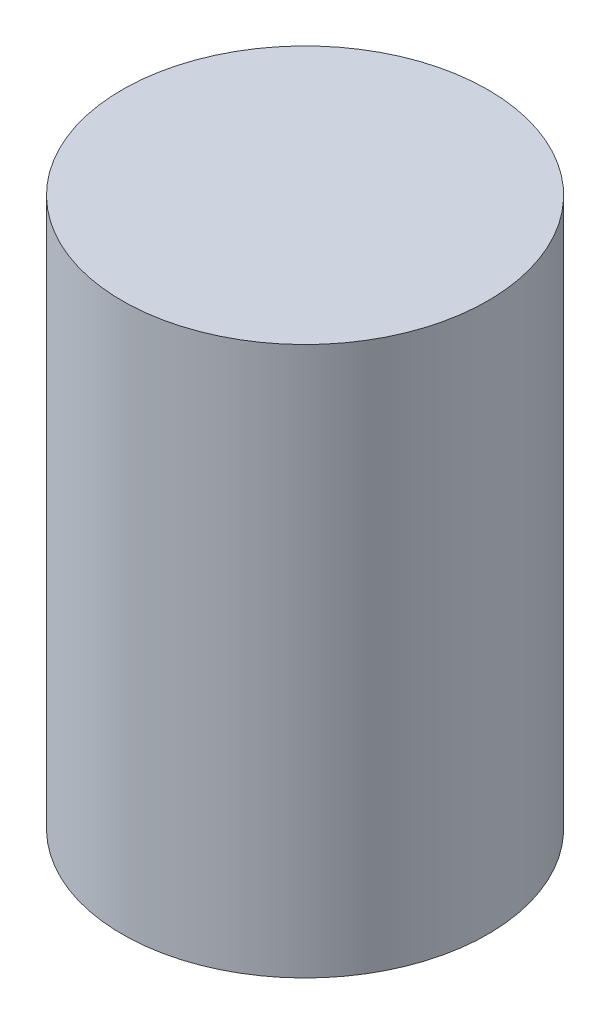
ISO-10303-21;
HEADER;
FILE_DESCRIPTION(('STEP AP214'),'2;1');
FILE_NAME('part.step','',(''),(''),'','','');
FILE_SCHEMA(('AUTOMOTIVE_DESIGN { 1 0 10303 214 1 1 1 1 }'));
ENDSEC;
DATA;
#1=APPLICATION_CONTEXT('core data for automotive mechanical design processes');
#2=APPLICATION_PROTOCOL_DEFINITION('international standard','automotive_design',2000,#1);
#3=PRODUCT_CONTEXT('',#1,'mechanical');
#4=PRODUCT('Part','Part','',(#3));
#5=PRODUCT_RELATED_PRODUCT_CATEGORY('part','',(#4));
#6=PRODUCT_DEFINITION_FORMATION('','',#4);
#7=PRODUCT_DEFINITION_CONTEXT('part definition',#1,'design');
#8=PRODUCT_DEFINITION('design','',#6,#7);
#9=PRODUCT_DEFINITION_SHAPE('','',#8);
#10=(LENGTH_UNIT() NAMED_UNIT(*) SI_UNIT(.MILLI.,.METRE.));
#11=(NAMED_UNIT(*) PLANE_ANGLE_UNIT() SI_UNIT($,.RADIAN.));
#12=(NAMED_UNIT(*) SI_UNIT($,.STERADIAN.) SOLID_ANGLE_UNIT());
#13=UNCERTAINTY_MEASURE_WITH_UNIT(LENGTH_MEASURE(1.E-05),#10,'distance_accuracy_value','');
#14=(GEOMETRIC_REPRESENTATION_CONTEXT(3) GLOBAL_UNCERTAINTY_ASSIGNED_CONTEXT((#13)) GLOBAL_UNIT_ASSIGNED_CONTEXT((#10,
#11,#12)) REPRESENTATION_CONTEXT('',''));
#15=CARTESIAN_POINT('',(0.,0.,0.));
#16=DIRECTION('',(0.,0.,1.));
#17=DIRECTION('',(1.,0.,0.));
#18=AXIS2_PLACEMENT_3D('',#15,#16,#17);
#19=CARTESIAN_POINT('',(0.,-508.,0.));
#20=DIRECTION('',(0.,-1.,0.));
#21=DIRECTION('',(0.,0.,-1.));
#22=AXIS2_PLACEMENT_3D('',#19,#20,#21);
#23=PLANE('',#22);
#24=CARTESIAN_POINT('',(0.,-508.,0.));
#25=DIRECTION('',(0.,-1.,0.));
#26=DIRECTION('',(0.,0.,-1.));
#27=AXIS2_PLACEMENT_3D('',#24,#25,#26);
#28=CIRCLE('',#27,254.);
#29=CARTESIAN_POINT('',(0.,-508.,-254.));
#30=VERTEX_POINT('',#29);
#31=EDGE_CURVE('E115',#30,#30,#28,.T.);
#32=ORIENTED_EDGE('',*,*,#31,.T.);
#33=EDGE_LOOP('',(#32));
#34=FACE_BOUND('',#33,.T.);
#35=DIRECTION('',(0.,0.,1.));
#36=VECTOR('',#35,1.);
#37=CARTESIAN_POINT('',(-9.525,-508.,50.8));
#38=LINE('',#37,#36);
#39=CARTESIAN_POINT('',(-9.525,-508.,-50.8000000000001));
#40=VERTEX_POINT('',#39);
#41=CARTESIAN_POINT('',(-9.525,-508.,50.8));
#42=VERTEX_POINT('',#41);
#43=EDGE_CURVE('E50',#40,#42,#38,.T.);
#44=ORIENTED_EDGE('',*,*,#43,.T.);
#45=DIRECTION('',(-1.,0.,0.));
#46=VECTOR('',#45,1.);
#47=CARTESIAN_POINT('',(9.525,-508.,50.8));
#48=LINE('',#47,#46);
#49=CARTESIAN_POINT('',(9.525,-508.,50.8));
#50=VERTEX_POINT('',#49);
#51=EDGE_CURVE('E96',#50,#42,#48,.T.);
#52=ORIENTED_EDGE('',*,*,#51,.F.);
#53=DIRECTION('',(0.,0.,1.));
#54=VECTOR('',#53,1.);
#55=CARTESIAN_POINT('',(9.525,-508.,50.8));
#56=LINE('',#55,#54);
#57=CARTESIAN_POINT('',(9.525,-508.,-50.8000000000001));
#58=VERTEX_POINT('',#57);
#59=EDGE_CURVE('E90',#58,#50,#56,.T.);
#60=ORIENTED_EDGE('',*,*,#59,.F.);
#61=DIRECTION('',(-1.,0.,0.));
#62=VECTOR('',#61,1.);
#63=CARTESIAN_POINT('',(9.525,-508.,-50.8000000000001));
#64=LINE('',#63,#62);
#65=EDGE_CURVE('E101',#58,#40,#64,.T.);
#66=ORIENTED_EDGE('',*,*,#65,.T.);
#67=EDGE_LOOP('',(#44,#52,#60,#66));
#68=FACE_BOUND('',#67,.T.);
#69=ADVANCED_FACE('F34',(#34,#68),#23,.T.);
#70=CARTESIAN_POINT('',(0.,254.,0.));
#71=DIRECTION('',(0.,1.,0.));
#72=DIRECTION('',(0.,0.,1.));
#73=AXIS2_PLACEMENT_3D('',#70,#71,#72);
#74=PLANE('',#73);
#75=CARTESIAN_POINT('',(0.,254.,0.));
#76=DIRECTION('',(0.,-1.,0.));
#77=DIRECTION('',(0.,0.,-1.));
#78=AXIS2_PLACEMENT_3D('',#75,#76,#77);
#79=CIRCLE('',#78,254.);
#80=CARTESIAN_POINT('',(0.,254.,-254.));
#81=VERTEX_POINT('',#80);
#82=EDGE_CURVE('E118',#81,#81,#79,.T.);
#83=ORIENTED_EDGE('',*,*,#82,.F.);
#84=EDGE_LOOP('',(#83));
#85=FACE_BOUND('',#84,.T.);
#86=ADVANCED_FACE('F136',(#85),#74,.T.);
#87=CARTESIAN_POINT('',(0.,-508.,0.));
#88=DIRECTION('',(0.,-1.,0.));
#89=DIRECTION('',(0.,0.,-1.));
#90=AXIS2_PLACEMENT_3D('',#87,#88,#89);
#91=CYLINDRICAL_SURFACE('',#90,254.);
#92=ORIENTED_EDGE('',*,*,#82,.T.);
#93=EDGE_LOOP('',(#92));
#94=FACE_BOUND('',#93,.T.);
#95=ORIENTED_EDGE('',*,*,#31,.F.);
#96=EDGE_LOOP('',(#95));
#97=FACE_BOUND('',#96,.T.);
#98=ADVANCED_FACE('F139',(#94,#97),#91,.T.);
#99=CARTESIAN_POINT('',(9.525,0.,0.));
#100=DIRECTION('',(-1.,0.,0.));
#101=DIRECTION('',(0.,0.,1.));
#102=AXIS2_PLACEMENT_3D('',#99,#100,#101);
#103=PLANE('',#102);
#104=ORIENTED_EDGE('',*,*,#59,.T.);
#105=DIRECTION('',(0.,-0.894427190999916,-0.447213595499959));
#106=VECTOR('',#105,1.);
#107=CARTESIAN_POINT('',(9.525,-508.,50.8));
#108=LINE('',#107,#106);
#109=CARTESIAN_POINT('',(9.525,-558.8,25.3999999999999));
#110=VERTEX_POINT('',#109);
#111=EDGE_CURVE('E84',#50,#110,#108,.T.);
#112=ORIENTED_EDGE('',*,*,#111,.T.);
#113=DIRECTION('',(0.,0.,-1.));
#114=VECTOR('',#113,1.);
#115=CARTESIAN_POINT('',(9.525,-558.8,25.3999999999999));
#116=LINE('',#115,#114);
#117=CARTESIAN_POINT('',(9.525,-558.8,-25.4000000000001));
#118=VERTEX_POINT('',#117);
#119=EDGE_CURVE('E88',#110,#118,#116,.T.);
#120=ORIENTED_EDGE('',*,*,#119,.T.);
#121=DIRECTION('',(0.,0.894427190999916,-0.447213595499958));
#122=VECTOR('',#121,1.);
#123=CARTESIAN_POINT('',(9.525,-508.,-50.8000000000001));
#124=LINE('',#123,#122);
#125=EDGE_CURVE('E59',#118,#58,#124,.T.);
#126=ORIENTED_EDGE('',*,*,#125,.T.);
#127=EDGE_LOOP('',(#104,#112,#120,#126));
#128=FACE_BOUND('',#127,.T.);
#129=CARTESIAN_POINT('',(9.525,-533.4,0.));
#130=DIRECTION('',(1.,0.,0.));
#131=DIRECTION('',(0.,0.,-1.));
#132=AXIS2_PLACEMENT_3D('',#129,#130,#131);
#133=CIRCLE('',#132,12.7);
#134=CARTESIAN_POINT('',(9.525,-533.4,12.6999999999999));
#135=VERTEX_POINT('',#134);
#136=EDGE_CURVE('E106',#135,#135,#133,.T.);
#137=ORIENTED_EDGE('',*,*,#136,.F.);
#138=EDGE_LOOP('',(#137));
#139=FACE_BOUND('',#138,.T.);
#140=ADVANCED_FACE('F85',(#128,#139),#103,.F.);
#141=CARTESIAN_POINT('',(-9.525,0.,0.));
#142=DIRECTION('',(-1.,0.,0.));
#143=DIRECTION('',(0.,0.,1.));
#144=AXIS2_PLACEMENT_3D('',#141,#142,#143);
#145=PLANE('',#144);
#146=ORIENTED_EDGE('',*,*,#43,.F.);
#147=DIRECTION('',(0.,0.894427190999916,-0.447213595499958));
#148=VECTOR('',#147,1.);
#149=CARTESIAN_POINT('',(-9.525,-508.,-50.8000000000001));
#150=LINE('',#149,#148);
#151=CARTESIAN_POINT('',(-9.525,-558.8,-25.4000000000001));
#152=VERTEX_POINT('',#151);
#153=EDGE_CURVE('E109',#152,#40,#150,.T.);
#154=ORIENTED_EDGE('',*,*,#153,.F.);
#155=DIRECTION('',(0.,0.,-1.));
#156=VECTOR('',#155,1.);
#157=CARTESIAN_POINT('',(-9.525,-558.8,25.3999999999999));
#158=LINE('',#157,#156);
#159=CARTESIAN_POINT('',(-9.525,-558.8,25.3999999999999));
#160=VERTEX_POINT('',#159);
#161=EDGE_CURVE('E76',#160,#152,#158,.T.);
#162=ORIENTED_EDGE('',*,*,#161,.F.);
#163=DIRECTION('',(0.,-0.894427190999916,-0.447213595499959));
#164=VECTOR('',#163,1.);
#165=CARTESIAN_POINT('',(-9.525,-508.,50.8));
#166=LINE('',#165,#164);
#167=EDGE_CURVE('E95',#42,#160,#166,.T.);
#168=ORIENTED_EDGE('',*,*,#167,.F.);
#169=EDGE_LOOP('',(#146,#154,#162,#168));
#170=FACE_BOUND('',#169,.T.);
#171=CARTESIAN_POINT('',(-9.525,-533.4,0.));
#172=DIRECTION('',(1.,0.,0.));
#173=DIRECTION('',(0.,0.,-1.));
#174=AXIS2_PLACEMENT_3D('',#171,#172,#173);
#175=CIRCLE('',#174,12.7);
#176=CARTESIAN_POINT('',(-9.525,-533.4,12.6999999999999));
#177=VERTEX_POINT('',#176);
#178=EDGE_CURVE('E170',#177,#177,#175,.T.);
#179=ORIENTED_EDGE('',*,*,#178,.T.);
#180=EDGE_LOOP('',(#179));
#181=FACE_BOUND('',#180,.T.);
#182=ADVANCED_FACE('F149',(#170,#181),#145,.T.);
#183=CARTESIAN_POINT('',(9.525,-508.,50.8));
#184=DIRECTION('',(0.,0.447213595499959,-0.894427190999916));
#185=DIRECTION('',(0.,0.894427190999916,0.447213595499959));
#186=AXIS2_PLACEMENT_3D('',#183,#184,#185);
#187=PLANE('',#186);
#188=ORIENTED_EDGE('',*,*,#167,.T.);
#189=DIRECTION('',(-1.,0.,0.));
#190=VECTOR('',#189,1.);
#191=CARTESIAN_POINT('',(9.525,-558.8,25.3999999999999));
#192=LINE('',#191,#190);
#193=EDGE_CURVE('E93',#110,#160,#192,.T.);
#194=ORIENTED_EDGE('',*,*,#193,.F.);
#195=ORIENTED_EDGE('',*,*,#111,.F.);
#196=ORIENTED_EDGE('',*,*,#51,.T.);
#197=EDGE_LOOP('',(#188,#194,#195,#196));
#198=FACE_BOUND('',#197,.T.);
#199=ADVANCED_FACE('F94',(#198),#187,.F.);
#200=CARTESIAN_POINT('',(9.525,-558.8,25.3999999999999));
#201=DIRECTION('',(0.,1.,0.));
#202=DIRECTION('',(0.,0.,1.));
#203=AXIS2_PLACEMENT_3D('',#200,#201,#202);
#204=PLANE('',#203);
#205=ORIENTED_EDGE('',*,*,#161,.T.);
#206=DIRECTION('',(-1.,0.,0.));
#207=VECTOR('',#206,1.);
#208=CARTESIAN_POINT('',(9.525,-558.8,-25.4000000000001));
#209=LINE('',#208,#207);
#210=EDGE_CURVE('E97',#118,#152,#209,.T.);
#211=ORIENTED_EDGE('',*,*,#210,.F.);
#212=ORIENTED_EDGE('',*,*,#119,.F.);
#213=ORIENTED_EDGE('',*,*,#193,.T.);
#214=EDGE_LOOP('',(#205,#211,#212,#213));
#215=FACE_BOUND('',#214,.T.);
#216=ADVANCED_FACE('F99',(#215),#204,.F.);
#217=CARTESIAN_POINT('',(9.525,-508.,-50.8000000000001));
#218=DIRECTION('',(0.,0.447213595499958,0.894427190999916));
#219=DIRECTION('',(0.,-0.894427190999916,0.447213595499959));
#220=AXIS2_PLACEMENT_3D('',#217,#218,#219);
#221=PLANE('',#220);
#222=ORIENTED_EDGE('',*,*,#153,.T.);
#223=ORIENTED_EDGE('',*,*,#65,.F.);
#224=ORIENTED_EDGE('',*,*,#125,.F.);
#225=ORIENTED_EDGE('',*,*,#210,.T.);
#226=EDGE_LOOP('',(#222,#223,#224,#225));
#227=FACE_BOUND('',#226,.T.);
#228=ADVANCED_FACE('F152',(#227),#221,.F.);
#229=CARTESIAN_POINT('',(9.525,-533.4,0.));
#230=DIRECTION('',(-1.,0.,0.));
#231=DIRECTION('',(0.,0.,1.));
#232=AXIS2_PLACEMENT_3D('',#229,#230,#231);
#233=CYLINDRICAL_SURFACE('',#232,12.7);
#234=CARTESIAN_POINT('',(9.525,-533.4,12.6999999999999));
#235=CARTESIAN_POINT('',(9.3265625,-533.4,12.6999999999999));
#236=CARTESIAN_POINT('',(9.128125,-533.4,12.6999999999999));
#237=CARTESIAN_POINT('',(8.73125,-533.4,12.6999999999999));
#238=CARTESIAN_POINT('',(8.5328125,-533.4,12.6999999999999));
#239=CARTESIAN_POINT('',(8.1359375,-533.4,12.6999999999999));
#240=CARTESIAN_POINT('',(7.9375,-533.4,12.6999999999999));
#241=CARTESIAN_POINT('',(7.540625,-533.4,12.6999999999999));
#242=CARTESIAN_POINT('',(7.3421875,-533.4,12.6999999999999));
#243=CARTESIAN_POINT('',(6.9453125,-533.4,12.6999999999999));
#244=CARTESIAN_POINT('',(6.746875,-533.4,12.6999999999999));
#245=CARTESIAN_POINT('',(6.35,-533.4,12.6999999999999));
#246=CARTESIAN_POINT('',(6.1515625,-533.4,12.6999999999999));
#247=CARTESIAN_POINT('',(5.7546875,-533.4,12.6999999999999));
#248=CARTESIAN_POINT('',(5.55625,-533.4,12.6999999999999));
#249=CARTESIAN_POINT('',(5.159375,-533.4,12.6999999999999));
#250=CARTESIAN_POINT('',(4.9609375,-533.4,12.6999999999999));
#251=CARTESIAN_POINT('',(4.5640625,-533.4,12.6999999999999));
#252=CARTESIAN_POINT('',(4.365625,-533.4,12.6999999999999));
#253=CARTESIAN_POINT('',(3.96875,-533.4,12.6999999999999));
#254=CARTESIAN_POINT('',(3.7703125,-533.4,12.6999999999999));
#255=CARTESIAN_POINT('',(3.3734375,-533.4,12.6999999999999));
#256=CARTESIAN_POINT('',(3.175,-533.4,12.6999999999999));
#257=CARTESIAN_POINT('',(2.778125,-533.4,12.6999999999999));
#258=CARTESIAN_POINT('',(2.5796875,-533.4,12.6999999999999));
#259=CARTESIAN_POINT('',(2.1828125,-533.4,12.6999999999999));
#260=CARTESIAN_POINT('',(1.984375,-533.4,12.6999999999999));
#261=CARTESIAN_POINT('',(1.5875,-533.4,12.6999999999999));
#262=CARTESIAN_POINT('',(1.3890625,-533.4,12.6999999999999));
#263=CARTESIAN_POINT('',(0.992187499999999,-533.4,12.6999999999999));
#264=CARTESIAN_POINT('',(0.793749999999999,-533.4,12.6999999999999));
#265=CARTESIAN_POINT('',(0.396874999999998,-533.4,12.6999999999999));
#266=CARTESIAN_POINT('',(0.198437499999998,-533.4,12.6999999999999));
#267=CARTESIAN_POINT('',(-0.198437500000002,-533.4,12.6999999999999));
#268=CARTESIAN_POINT('',(-0.396875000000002,-533.4,12.6999999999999));
#269=CARTESIAN_POINT('',(-0.793750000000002,-533.4,12.6999999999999));
#270=CARTESIAN_POINT('',(-0.992187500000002,-533.4,12.6999999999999));
#271=CARTESIAN_POINT('',(-1.3890625,-533.4,12.6999999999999));
#272=CARTESIAN_POINT('',(-1.5875,-533.4,12.6999999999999));
#273=CARTESIAN_POINT('',(-1.984375,-533.4,12.6999999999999));
#274=CARTESIAN_POINT('',(-2.1828125,-533.4,12.6999999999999));
#275=CARTESIAN_POINT('',(-2.5796875,-533.4,12.6999999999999));
#276=CARTESIAN_POINT('',(-2.778125,-533.4,12.6999999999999));
#277=CARTESIAN_POINT('',(-3.175,-533.4,12.6999999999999));
#278=CARTESIAN_POINT('',(-3.3734375,-533.4,12.6999999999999));
#279=CARTESIAN_POINT('',(-3.7703125,-533.4,12.6999999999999));
#280=CARTESIAN_POINT('',(-3.96875,-533.4,12.6999999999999));
#281=CARTESIAN_POINT('',(-4.365625,-533.4,12.6999999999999));
#282=CARTESIAN_POINT('',(-4.5640625,-533.4,12.6999999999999));
#283=CARTESIAN_POINT('',(-4.9609375,-533.4,12.6999999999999));
#284=CARTESIAN_POINT('',(-5.159375,-533.4,12.6999999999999));
#285=CARTESIAN_POINT('',(-5.55625,-533.4,12.6999999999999));
#286=CARTESIAN_POINT('',(-5.7546875,-533.4,12.6999999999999));
#287=CARTESIAN_POINT('',(-6.1515625,-533.4,12.6999999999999));
#288=CARTESIAN_POINT('',(-6.35,-533.4,12.6999999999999));
#289=CARTESIAN_POINT('',(-6.746875,-533.4,12.6999999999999));
#290=CARTESIAN_POINT('',(-6.9453125,-533.4,12.6999999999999));
#291=CARTESIAN_POINT('',(-7.3421875,-533.4,12.6999999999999));
#292=CARTESIAN_POINT('',(-7.540625,-533.4,12.6999999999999));
#293=CARTESIAN_POINT('',(-7.9375,-533.4,12.6999999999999));
#294=CARTESIAN_POINT('',(-8.1359375,-533.4,12.6999999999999));
#295=CARTESIAN_POINT('',(-8.5328125,-533.4,12.6999999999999));
#296=CARTESIAN_POINT('',(-8.73125,-533.4,12.6999999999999));
#297=CARTESIAN_POINT('',(-9.128125,-533.4,12.6999999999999));
#298=CARTESIAN_POINT('',(-9.3265625,-533.4,12.6999999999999));
#299=CARTESIAN_POINT('',(-9.525,-533.4,12.6999999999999));
#300=B_SPLINE_CURVE_WITH_KNOTS('',3,(#234,#235,#236,#237,#238,#239,#240,#241,#242,#243,#244,
#245,#246,#247,#248,#249,#250,#251,#252,#253,#254,#255,#256,#257,#258,#259,#260,#261,#262,#263,
#264,#265,#266,#267,#268,#269,#270,#271,#272,#273,#274,#275,#276,#277,#278,#279,#280,#281,#282,
#283,#284,#285,#286,#287,#288,#289,#290,#291,#292,#293,#294,#295,#296,#297,#298,#299),
.UNSPECIFIED.,.F.,.F.,(4,2,2,2,2,2,2,2,2,2,2,2,2,2,2,2,2,2,2,2,2,2,2,2,2,2,2,2,2,2,2,2,4),(0.,
0.595312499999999,1.190625,1.7859375,2.38125,2.9765625,3.571875,4.1671875,4.7625,5.3578125,
5.953125,6.5484375,7.14375,7.7390625,8.334375,8.9296875,9.525,10.1203125,10.715625,11.3109375,
11.90625,12.5015625,13.096875,13.6921875,14.2875,14.8828125,15.478125,16.0734375,16.66875,
17.2640625,17.859375,18.4546875,19.05),.UNSPECIFIED.);
#301=EDGE_CURVE('BSEAM155',#135,#177,#300,.T.);
#302=ORIENTED_EDGE('',*,*,#136,.T.);
#303=ORIENTED_EDGE('',*,*,#178,.F.);
#304=ORIENTED_EDGE('',*,*,#301,.T.);
#305=ORIENTED_EDGE('',*,*,#301,.F.);
#306=EDGE_LOOP('',(#302,#304,#303,#305));
#307=FACE_BOUND('',#306,.T.);
#308=ADVANCED_FACE('F155',(#307),#233,.F.);
#309=CLOSED_SHELL('',(#69,#86,#98,#140,#182,#199,#216,#228,#308));
#310=CARTESIAN_POINT('',(0.,-501.65,0.));
#311=DIRECTION('',(0.,1.,0.));
#312=DIRECTION('',(0.,0.,1.));
#313=AXIS2_PLACEMENT_3D('',#310,#311,#312);
#314=PLANE('',#313);
#315=CARTESIAN_POINT('',(0.,-501.65,0.));
#316=DIRECTION('',(0.,-1.,0.));
#317=DIRECTION('',(0.,0.,-1.));
#318=AXIS2_PLACEMENT_3D('',#315,#316,#317);
#319=CIRCLE('',#318,247.65);
#320=CARTESIAN_POINT('',(0.,-501.65,-247.65));
#321=VERTEX_POINT('',#320);
#322=EDGE_CURVE('E11',#321,#321,#319,.T.);
#323=ORIENTED_EDGE('',*,*,#322,.F.);
#324=EDGE_LOOP('',(#323));
#325=FACE_BOUND('',#324,.T.);
#326=ADVANCED_FACE('F36',(#325),#314,.T.);
#327=CARTESIAN_POINT('',(0.,-508.,0.));
#328=DIRECTION('',(0.,-1.,0.));
#329=DIRECTION('',(0.,0.,-1.));
#330=AXIS2_PLACEMENT_3D('',#327,#328,#329);
#331=CYLINDRICAL_SURFACE('',#330,247.65);
#332=ORIENTED_EDGE('',*,*,#322,.T.);
#333=EDGE_LOOP('',(#332));
#334=FACE_BOUND('',#333,.T.);
#335=CARTESIAN_POINT('',(0.,247.65,0.));
#336=DIRECTION('',(0.,-1.,0.));
#337=DIRECTION('',(0.,0.,-1.));
#338=AXIS2_PLACEMENT_3D('',#335,#336,#337);
#339=CIRCLE('',#338,247.65);
#340=CARTESIAN_POINT('',(0.,247.65,-247.65));
#341=VERTEX_POINT('',#340);
#342=EDGE_CURVE('E43',#341,#341,#339,.T.);
#343=ORIENTED_EDGE('',*,*,#342,.F.);
#344=EDGE_LOOP('',(#343));
#345=FACE_BOUND('',#344,.T.);
#346=ADVANCED_FACE('F125',(#334,#345),#331,.F.);
#347=CARTESIAN_POINT('',(0.,247.65,0.));
#348=DIRECTION('',(0.,-1.,0.));
#349=DIRECTION('',(0.,0.,-1.));
#350=AXIS2_PLACEMENT_3D('',#347,#348,#349);
#351=PLANE('',#350);
#352=ORIENTED_EDGE('',*,*,#342,.T.);
#353=EDGE_LOOP('',(#352));
#354=FACE_BOUND('',#353,.T.);
#355=ADVANCED_FACE('F123',(#354),#351,.T.);
#356=CLOSED_SHELL('',(#326,#346,#355));
#357=ORIENTED_CLOSED_SHELL('',*,#356,.T.);
#358=BREP_WITH_VOIDS('B2',#309,(#357));
#359=ADVANCED_BREP_SHAPE_REPRESENTATION('',(#18,#358),#14);
#360=SHAPE_DEFINITION_REPRESENTATION(#9,#359);
ENDSEC;
END-ISO-10303-21;
